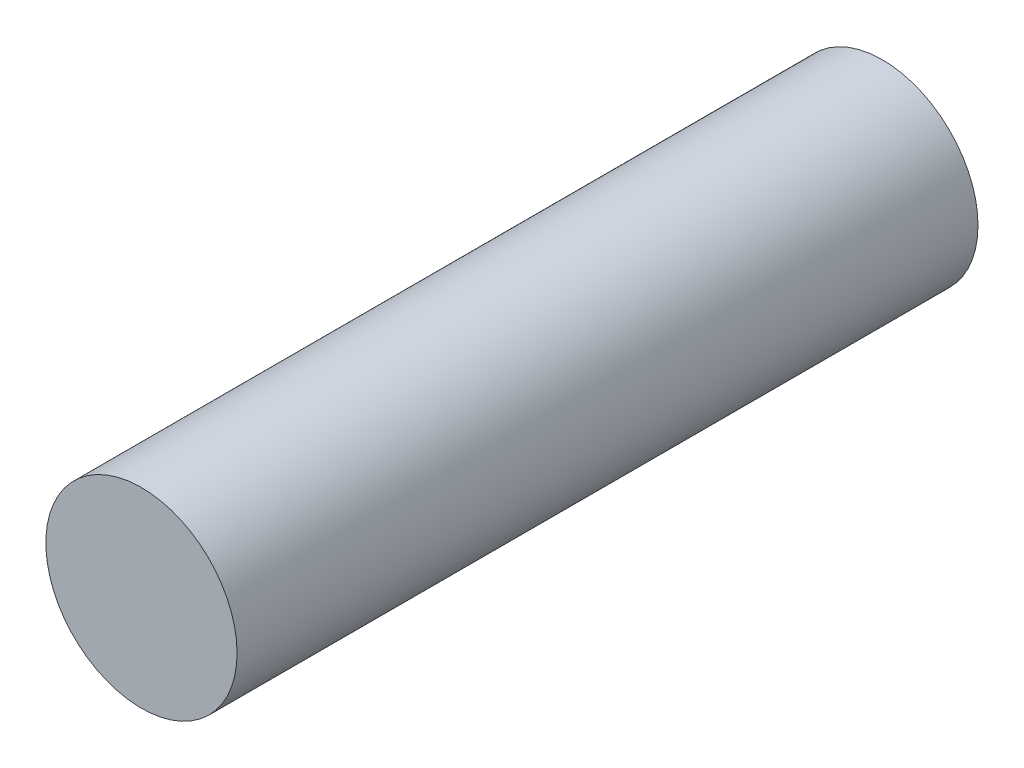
ISO-10303-21;
HEADER;
FILE_DESCRIPTION(('STEP AP214'),'2;1');
FILE_NAME('part.step','',(''),(''),'','','');
FILE_SCHEMA(('AUTOMOTIVE_DESIGN { 1 0 10303 214 1 1 1 1 }'));
ENDSEC;
DATA;
#1=APPLICATION_CONTEXT('core data for automotive mechanical design processes');
#2=APPLICATION_PROTOCOL_DEFINITION('international standard','automotive_design',2000,#1);
#3=PRODUCT_CONTEXT('',#1,'mechanical');
#4=PRODUCT('Part','Part','',(#3));
#5=PRODUCT_RELATED_PRODUCT_CATEGORY('part','',(#4));
#6=PRODUCT_DEFINITION_FORMATION('','',#4);
#7=PRODUCT_DEFINITION_CONTEXT('part definition',#1,'design');
#8=PRODUCT_DEFINITION('design','',#6,#7);
#9=PRODUCT_DEFINITION_SHAPE('','',#8);
#10=(LENGTH_UNIT() NAMED_UNIT(*) SI_UNIT(.MILLI.,.METRE.));
#11=(NAMED_UNIT(*) PLANE_ANGLE_UNIT() SI_UNIT($,.RADIAN.));
#12=(NAMED_UNIT(*) SI_UNIT($,.STERADIAN.) SOLID_ANGLE_UNIT());
#13=UNCERTAINTY_MEASURE_WITH_UNIT(LENGTH_MEASURE(1.E-05),#10,'distance_accuracy_value','');
#14=(GEOMETRIC_REPRESENTATION_CONTEXT(3) GLOBAL_UNCERTAINTY_ASSIGNED_CONTEXT((#13)) GLOBAL_UNIT_ASSIGNED_CONTEXT((#10,
#11,#12)) REPRESENTATION_CONTEXT('',''));
#15=CARTESIAN_POINT('',(0.,0.,0.));
#16=DIRECTION('',(0.,0.,1.));
#17=DIRECTION('',(1.,0.,0.));
#18=AXIS2_PLACEMENT_3D('',#15,#16,#17);
#19=CARTESIAN_POINT('',(0.,0.,250.));
#20=DIRECTION('',(0.,0.,-1.));
#21=DIRECTION('',(-1.,0.,0.));
#22=AXIS2_PLACEMENT_3D('',#19,#20,#21);
#23=CYLINDRICAL_SURFACE('',#22,64.524693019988);
#24=CARTESIAN_POINT('',(0.,0.,250.));
#25=DIRECTION('',(0.,0.,1.));
#26=DIRECTION('',(1.,0.,0.));
#27=AXIS2_PLACEMENT_3D('',#24,#25,#26);
#28=CIRCLE('',#27,64.524693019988);
#29=CARTESIAN_POINT('',(64.524693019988,0.,250.));
#30=VERTEX_POINT('',#29);
#31=EDGE_CURVE('E10',#30,#30,#28,.T.);
#32=ORIENTED_EDGE('',*,*,#31,.F.);
#33=EDGE_LOOP('',(#32));
#34=FACE_BOUND('',#33,.T.);
#35=CARTESIAN_POINT('',(0.,0.,-250.));
#36=DIRECTION('',(0.,0.,1.));
#37=DIRECTION('',(1.,0.,0.));
#38=AXIS2_PLACEMENT_3D('',#35,#36,#37);
#39=CIRCLE('',#38,64.524693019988);
#40=CARTESIAN_POINT('',(64.524693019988,0.,-250.));
#41=VERTEX_POINT('',#40);
#42=EDGE_CURVE('E34',#41,#41,#39,.T.);
#43=ORIENTED_EDGE('',*,*,#42,.T.);
#44=EDGE_LOOP('',(#43));
#45=FACE_BOUND('',#44,.T.);
#46=ADVANCED_FACE('F31',(#34,#45),#23,.T.);
#47=CARTESIAN_POINT('',(0.,0.,250.));
#48=DIRECTION('',(0.,0.,1.));
#49=DIRECTION('',(1.,0.,0.));
#50=AXIS2_PLACEMENT_3D('',#47,#48,#49);
#51=PLANE('',#50);
#52=ORIENTED_EDGE('',*,*,#31,.T.);
#53=EDGE_LOOP('',(#52));
#54=FACE_BOUND('',#53,.T.);
#55=ADVANCED_FACE('F46',(#54),#51,.T.);
#56=CARTESIAN_POINT('',(0.,0.,-250.));
#57=DIRECTION('',(0.,0.,1.));
#58=DIRECTION('',(1.,0.,0.));
#59=AXIS2_PLACEMENT_3D('',#56,#57,#58);
#60=PLANE('',#59);
#61=ORIENTED_EDGE('',*,*,#42,.F.);
#62=EDGE_LOOP('',(#61));
#63=FACE_BOUND('',#62,.T.);
#64=ADVANCED_FACE('F44',(#63),#60,.F.);
#65=CLOSED_SHELL('',(#46,#55,#64));
#66=MANIFOLD_SOLID_BREP('B2',#65);
#67=ADVANCED_BREP_SHAPE_REPRESENTATION('',(#18,#66),#14);
#68=SHAPE_DEFINITION_REPRESENTATION(#9,#67);
ENDSEC;
END-ISO-10303-21;
